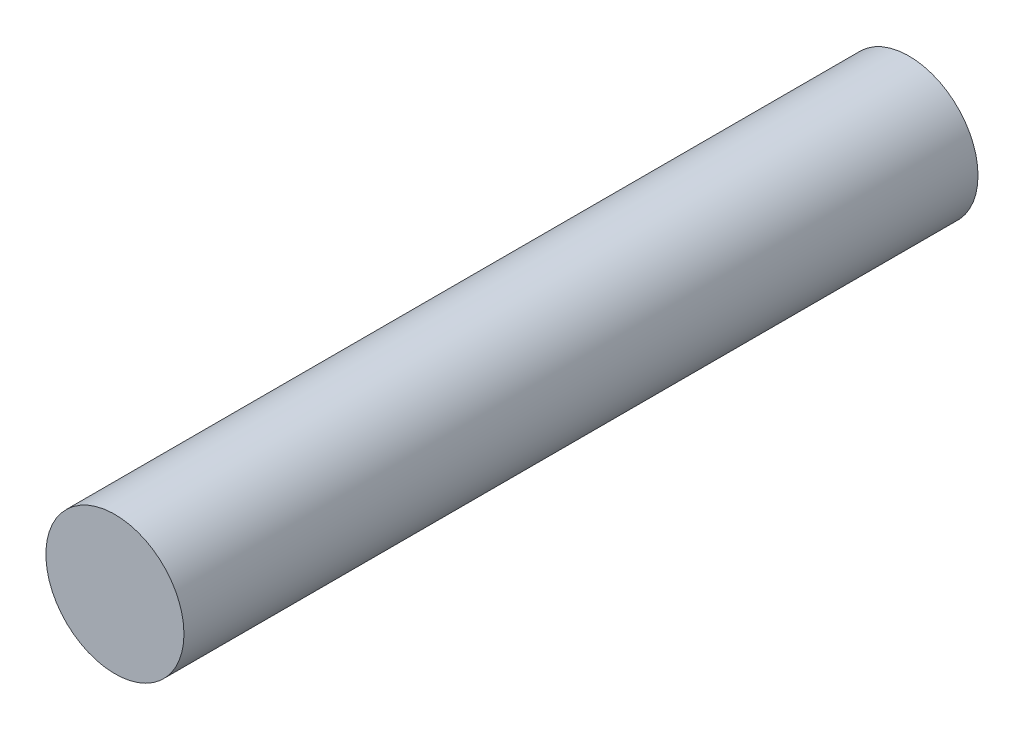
ISO-10303-21;
HEADER;
FILE_DESCRIPTION(('STEP AP214'),'2;1');
FILE_NAME('part.step','',(''),(''),'','','');
FILE_SCHEMA(('AUTOMOTIVE_DESIGN { 1 0 10303 214 1 1 1 1 }'));
ENDSEC;
DATA;
#1=APPLICATION_CONTEXT('core data for automotive mechanical design processes');
#2=APPLICATION_PROTOCOL_DEFINITION('international standard','automotive_design',2000,#1);
#3=PRODUCT_CONTEXT('',#1,'mechanical');
#4=PRODUCT('Part','Part','',(#3));
#5=PRODUCT_RELATED_PRODUCT_CATEGORY('part','',(#4));
#6=PRODUCT_DEFINITION_FORMATION('','',#4);
#7=PRODUCT_DEFINITION_CONTEXT('part definition',#1,'design');
#8=PRODUCT_DEFINITION('design','',#6,#7);
#9=PRODUCT_DEFINITION_SHAPE('','',#8);
#10=(LENGTH_UNIT() NAMED_UNIT(*) SI_UNIT(.MILLI.,.METRE.));
#11=(NAMED_UNIT(*) PLANE_ANGLE_UNIT() SI_UNIT($,.RADIAN.));
#12=(NAMED_UNIT(*) SI_UNIT($,.STERADIAN.) SOLID_ANGLE_UNIT());
#13=UNCERTAINTY_MEASURE_WITH_UNIT(LENGTH_MEASURE(1.E-05),#10,'distance_accuracy_value','');
#14=(GEOMETRIC_REPRESENTATION_CONTEXT(3) GLOBAL_UNCERTAINTY_ASSIGNED_CONTEXT((#13)) GLOBAL_UNIT_ASSIGNED_CONTEXT((#10,
#11,#12)) REPRESENTATION_CONTEXT('',''));
#15=CARTESIAN_POINT('',(0.,0.,0.));
#16=DIRECTION('',(0.,0.,1.));
#17=DIRECTION('',(1.,0.,0.));
#18=AXIS2_PLACEMENT_3D('',#15,#16,#17);
#19=CARTESIAN_POINT('',(0.,0.,11.5));
#20=DIRECTION('',(0.,0.,-1.));
#21=DIRECTION('',(-1.,0.,0.));
#22=AXIS2_PLACEMENT_3D('',#19,#20,#21);
#23=CYLINDRICAL_SURFACE('',#22,0.999999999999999);
#24=CARTESIAN_POINT('',(0.,0.,11.5));
#25=DIRECTION('',(0.,0.,1.));
#26=DIRECTION('',(1.,0.,0.));
#27=AXIS2_PLACEMENT_3D('',#24,#25,#26);
#28=CIRCLE('',#27,0.999999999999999);
#29=CARTESIAN_POINT('',(0.999999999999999,0.,11.5));
#30=VERTEX_POINT('',#29);
#31=EDGE_CURVE('E10',#30,#30,#28,.T.);
#32=ORIENTED_EDGE('',*,*,#31,.F.);
#33=EDGE_LOOP('',(#32));
#34=FACE_BOUND('',#33,.T.);
#35=CARTESIAN_POINT('',(0.,0.,0.));
#36=DIRECTION('',(0.,0.,1.));
#37=DIRECTION('',(1.,0.,0.));
#38=AXIS2_PLACEMENT_3D('',#35,#36,#37);
#39=CIRCLE('',#38,0.999999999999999);
#40=CARTESIAN_POINT('',(0.999999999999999,0.,0.));
#41=VERTEX_POINT('',#40);
#42=EDGE_CURVE('E36',#41,#41,#39,.T.);
#43=ORIENTED_EDGE('',*,*,#42,.T.);
#44=EDGE_LOOP('',(#43));
#45=FACE_BOUND('',#44,.T.);
#46=ADVANCED_FACE('F30',(#34,#45),#23,.T.);
#47=CARTESIAN_POINT('',(0.,0.,11.5));
#48=DIRECTION('',(0.,0.,1.));
#49=DIRECTION('',(1.,0.,0.));
#50=AXIS2_PLACEMENT_3D('',#47,#48,#49);
#51=PLANE('',#50);
#52=ORIENTED_EDGE('',*,*,#31,.T.);
#53=EDGE_LOOP('',(#52));
#54=FACE_BOUND('',#53,.T.);
#55=ADVANCED_FACE('F45',(#54),#51,.T.);
#56=CARTESIAN_POINT('',(0.,0.,0.));
#57=DIRECTION('',(0.,0.,1.));
#58=DIRECTION('',(1.,0.,0.));
#59=AXIS2_PLACEMENT_3D('',#56,#57,#58);
#60=PLANE('',#59);
#61=ORIENTED_EDGE('',*,*,#42,.F.);
#62=EDGE_LOOP('',(#61));
#63=FACE_BOUND('',#62,.T.);
#64=ADVANCED_FACE('F43',(#63),#60,.F.);
#65=CLOSED_SHELL('',(#46,#55,#64));
#66=MANIFOLD_SOLID_BREP('B2',#65);
#67=ADVANCED_BREP_SHAPE_REPRESENTATION('',(#18,#66),#14);
#68=SHAPE_DEFINITION_REPRESENTATION(#9,#67);
ENDSEC;
END-ISO-10303-21;
